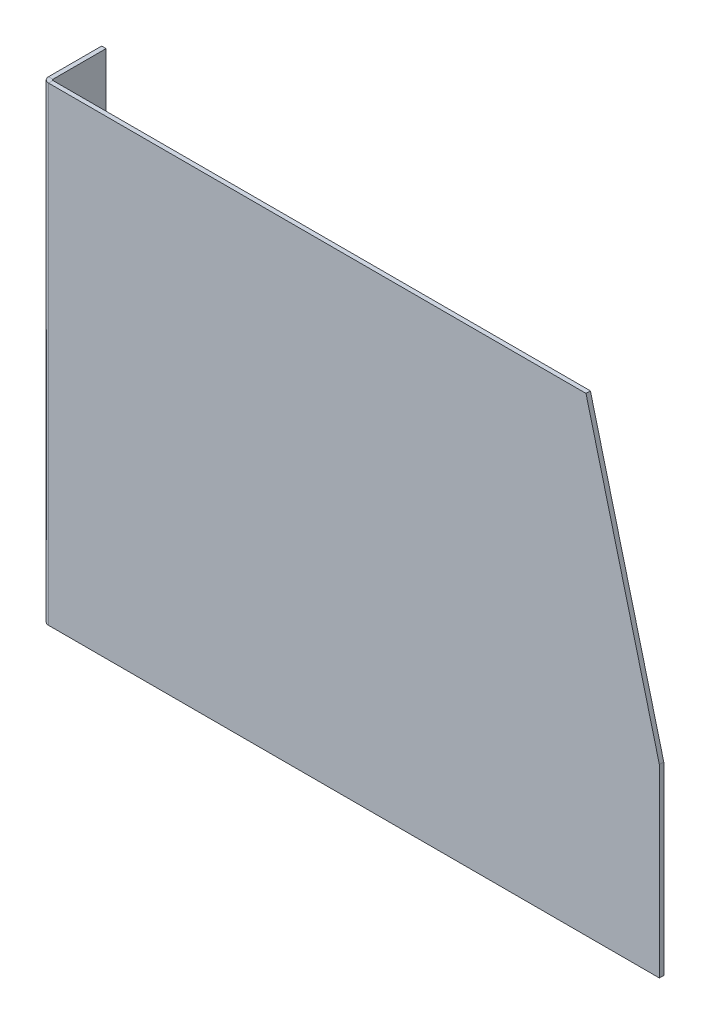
ISO-10303-21;
HEADER;
FILE_DESCRIPTION(('STEP AP214'),'2;1');
FILE_NAME('part.step','',(''),(''),'','','');
FILE_SCHEMA(('AUTOMOTIVE_DESIGN { 1 0 10303 214 1 1 1 1 }'));
ENDSEC;
DATA;
#1=APPLICATION_CONTEXT('core data for automotive mechanical design processes');
#2=APPLICATION_PROTOCOL_DEFINITION('international standard','automotive_design',2000,#1);
#3=PRODUCT_CONTEXT('',#1,'mechanical');
#4=PRODUCT('Part','Part','',(#3));
#5=PRODUCT_RELATED_PRODUCT_CATEGORY('part','',(#4));
#6=PRODUCT_DEFINITION_FORMATION('','',#4);
#7=PRODUCT_DEFINITION_CONTEXT('part definition',#1,'design');
#8=PRODUCT_DEFINITION('design','',#6,#7);
#9=PRODUCT_DEFINITION_SHAPE('','',#8);
#10=(LENGTH_UNIT() NAMED_UNIT(*) SI_UNIT(.MILLI.,.METRE.));
#11=(NAMED_UNIT(*) PLANE_ANGLE_UNIT() SI_UNIT($,.RADIAN.));
#12=(NAMED_UNIT(*) SI_UNIT($,.STERADIAN.) SOLID_ANGLE_UNIT());
#13=UNCERTAINTY_MEASURE_WITH_UNIT(LENGTH_MEASURE(1.E-05),#10,'distance_accuracy_value','');
#14=(GEOMETRIC_REPRESENTATION_CONTEXT(3) GLOBAL_UNCERTAINTY_ASSIGNED_CONTEXT((#13)) GLOBAL_UNIT_ASSIGNED_CONTEXT((#10,
#11,#12)) REPRESENTATION_CONTEXT('',''));
#15=CARTESIAN_POINT('',(0.,0.,0.));
#16=DIRECTION('',(0.,0.,1.));
#17=DIRECTION('',(1.,0.,0.));
#18=AXIS2_PLACEMENT_3D('',#15,#16,#17);
#19=CARTESIAN_POINT('',(417.,-320.,3.));
#20=DIRECTION('',(0.,1.,0.));
#21=DIRECTION('',(-1.,0.,0.));
#22=AXIS2_PLACEMENT_3D('',#19,#20,#21);
#23=PLANE('',#22);
#24=DIRECTION('',(0.,0.,1.));
#25=VECTOR('',#24,1.);
#26=CARTESIAN_POINT('',(0.736599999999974,-320.,0.));
#27=LINE('',#26,#25);
#28=CARTESIAN_POINT('',(0.736599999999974,-320.,0.));
#29=VERTEX_POINT('',#28);
#30=CARTESIAN_POINT('',(0.736599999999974,-320.,3.));
#31=VERTEX_POINT('',#30);
#32=EDGE_CURVE('E173',#29,#31,#27,.T.);
#33=ORIENTED_EDGE('',*,*,#32,.F.);
#34=DIRECTION('',(1.,0.,0.));
#35=VECTOR('',#34,1.);
#36=CARTESIAN_POINT('',(417.,-320.,0.));
#37=LINE('',#36,#35);
#38=CARTESIAN_POINT('',(417.,-320.,0.));
#39=VERTEX_POINT('',#38);
#40=EDGE_CURVE('E176',#29,#39,#37,.T.);
#41=ORIENTED_EDGE('',*,*,#40,.T.);
#42=DIRECTION('',(0.,0.,-1.));
#43=VECTOR('',#42,1.);
#44=CARTESIAN_POINT('',(417.,-320.,3.));
#45=LINE('',#44,#43);
#46=CARTESIAN_POINT('',(417.,-320.,3.));
#47=VERTEX_POINT('',#46);
#48=EDGE_CURVE('E11',#47,#39,#45,.T.);
#49=ORIENTED_EDGE('',*,*,#48,.F.);
#50=DIRECTION('',(1.,0.,0.));
#51=VECTOR('',#50,1.);
#52=CARTESIAN_POINT('',(417.,-320.,3.));
#53=LINE('',#52,#51);
#54=EDGE_CURVE('E186',#31,#47,#53,.T.);
#55=ORIENTED_EDGE('',*,*,#54,.F.);
#56=EDGE_LOOP('',(#33,#41,#49,#55));
#57=FACE_BOUND('',#56,.T.);
#58=ADVANCED_FACE('F43',(#57),#23,.F.);
#59=CARTESIAN_POINT('',(0.,0.,3.));
#60=DIRECTION('',(0.,-1.,0.));
#61=DIRECTION('',(0.,0.,-1.));
#62=AXIS2_PLACEMENT_3D('',#59,#60,#61);
#63=PLANE('',#62);
#64=DIRECTION('',(0.,0.,1.));
#65=VECTOR('',#64,1.);
#66=CARTESIAN_POINT('',(0.736599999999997,0.,0.));
#67=LINE('',#66,#65);
#68=CARTESIAN_POINT('',(0.736599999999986,0.,0.));
#69=VERTEX_POINT('',#68);
#70=CARTESIAN_POINT('',(0.73659999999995,0.,2.99999999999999));
#71=VERTEX_POINT('',#70);
#72=EDGE_CURVE('E171',#69,#71,#67,.T.);
#73=ORIENTED_EDGE('',*,*,#72,.T.);
#74=DIRECTION('',(-1.,0.,0.));
#75=VECTOR('',#74,1.);
#76=CARTESIAN_POINT('',(0.,0.,3.));
#77=LINE('',#76,#75);
#78=CARTESIAN_POINT('',(367.,0.,3.));
#79=VERTEX_POINT('',#78);
#80=EDGE_CURVE('E191',#79,#71,#77,.T.);
#81=ORIENTED_EDGE('',*,*,#80,.F.);
#82=DIRECTION('',(0.,0.,-1.));
#83=VECTOR('',#82,1.);
#84=CARTESIAN_POINT('',(367.,0.,3.));
#85=LINE('',#84,#83);
#86=CARTESIAN_POINT('',(367.,0.,0.));
#87=VERTEX_POINT('',#86);
#88=EDGE_CURVE('E193',#79,#87,#85,.T.);
#89=ORIENTED_EDGE('',*,*,#88,.T.);
#90=DIRECTION('',(-1.,0.,0.));
#91=VECTOR('',#90,1.);
#92=CARTESIAN_POINT('',(0.,0.,0.));
#93=LINE('',#92,#91);
#94=EDGE_CURVE('E184',#87,#69,#93,.T.);
#95=ORIENTED_EDGE('',*,*,#94,.T.);
#96=EDGE_LOOP('',(#73,#81,#89,#95));
#97=FACE_BOUND('',#96,.T.);
#98=ADVANCED_FACE('F205',(#97),#63,.F.);
#99=CARTESIAN_POINT('',(0.,0.,3.));
#100=DIRECTION('',(0.,0.,-1.));
#101=DIRECTION('',(-1.,0.,0.));
#102=AXIS2_PLACEMENT_3D('',#99,#100,#101);
#103=PLANE('',#102);
#104=DIRECTION('',(0.,1.,0.));
#105=VECTOR('',#104,1.);
#106=CARTESIAN_POINT('',(0.73659999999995,0.,2.99999999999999));
#107=LINE('',#106,#105);
#108=EDGE_CURVE('E122',#71,#31,#107,.F.);
#109=ORIENTED_EDGE('',*,*,#108,.T.);
#110=ORIENTED_EDGE('',*,*,#54,.T.);
#111=DIRECTION('',(0.,1.,0.));
#112=VECTOR('',#111,1.);
#113=CARTESIAN_POINT('',(417.,-194.,3.));
#114=LINE('',#113,#112);
#115=CARTESIAN_POINT('',(417.,-194.,3.));
#116=VERTEX_POINT('',#115);
#117=EDGE_CURVE('E188',#47,#116,#114,.T.);
#118=ORIENTED_EDGE('',*,*,#117,.T.);
#119=DIRECTION('',(-0.249576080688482,0.968355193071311,0.));
#120=VECTOR('',#119,1.);
#121=CARTESIAN_POINT('',(367.,0.,3.));
#122=LINE('',#121,#120);
#123=EDGE_CURVE('E65',#116,#79,#122,.T.);
#124=ORIENTED_EDGE('',*,*,#123,.T.);
#125=ORIENTED_EDGE('',*,*,#80,.T.);
#126=EDGE_LOOP('',(#109,#110,#118,#124,#125));
#127=FACE_BOUND('',#126,.T.);
#128=ADVANCED_FACE('F239',(#127),#103,.F.);
#129=CARTESIAN_POINT('',(0.,0.,0.));
#130=DIRECTION('',(0.,0.,-1.));
#131=DIRECTION('',(-1.,0.,0.));
#132=AXIS2_PLACEMENT_3D('',#129,#130,#131);
#133=PLANE('',#132);
#134=ORIENTED_EDGE('',*,*,#40,.F.);
#135=DIRECTION('',(0.,1.,0.));
#136=VECTOR('',#135,1.);
#137=CARTESIAN_POINT('',(0.736599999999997,0.,0.));
#138=LINE('',#137,#136);
#139=EDGE_CURVE('E57',#69,#29,#138,.F.);
#140=ORIENTED_EDGE('',*,*,#139,.F.);
#141=ORIENTED_EDGE('',*,*,#94,.F.);
#142=DIRECTION('',(-0.249576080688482,0.968355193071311,0.));
#143=VECTOR('',#142,1.);
#144=CARTESIAN_POINT('',(367.,0.,0.));
#145=LINE('',#144,#143);
#146=CARTESIAN_POINT('',(417.,-194.,0.));
#147=VERTEX_POINT('',#146);
#148=EDGE_CURVE('E182',#147,#87,#145,.T.);
#149=ORIENTED_EDGE('',*,*,#148,.F.);
#150=DIRECTION('',(0.,1.,0.));
#151=VECTOR('',#150,1.);
#152=CARTESIAN_POINT('',(417.,-194.,0.));
#153=LINE('',#152,#151);
#154=EDGE_CURVE('E180',#39,#147,#153,.T.);
#155=ORIENTED_EDGE('',*,*,#154,.F.);
#156=EDGE_LOOP('',(#134,#140,#141,#149,#155));
#157=FACE_BOUND('',#156,.T.);
#158=ADVANCED_FACE('F203',(#157),#133,.T.);
#159=CARTESIAN_POINT('',(417.,-194.,3.));
#160=DIRECTION('',(-1.,0.,0.));
#161=DIRECTION('',(0.,-1.,0.));
#162=AXIS2_PLACEMENT_3D('',#159,#160,#161);
#163=PLANE('',#162);
#164=ORIENTED_EDGE('',*,*,#154,.T.);
#165=DIRECTION('',(0.,0.,-1.));
#166=VECTOR('',#165,1.);
#167=CARTESIAN_POINT('',(417.,-194.,3.));
#168=LINE('',#167,#166);
#169=EDGE_CURVE('E50',#116,#147,#168,.T.);
#170=ORIENTED_EDGE('',*,*,#169,.F.);
#171=ORIENTED_EDGE('',*,*,#117,.F.);
#172=ORIENTED_EDGE('',*,*,#48,.T.);
#173=EDGE_LOOP('',(#164,#170,#171,#172));
#174=FACE_BOUND('',#173,.T.);
#175=ADVANCED_FACE('F252',(#174),#163,.F.);
#176=CARTESIAN_POINT('',(367.,0.,3.));
#177=DIRECTION('',(-0.968355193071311,-0.249576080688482,0.));
#178=DIRECTION('',(0.249576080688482,-0.968355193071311,0.));
#179=AXIS2_PLACEMENT_3D('',#176,#177,#178);
#180=PLANE('',#179);
#181=ORIENTED_EDGE('',*,*,#148,.T.);
#182=ORIENTED_EDGE('',*,*,#88,.F.);
#183=ORIENTED_EDGE('',*,*,#123,.F.);
#184=ORIENTED_EDGE('',*,*,#169,.T.);
#185=EDGE_LOOP('',(#181,#182,#183,#184));
#186=FACE_BOUND('',#185,.T.);
#187=ADVANCED_FACE('F199',(#186),#180,.F.);
#188=CARTESIAN_POINT('',(0.736599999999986,-320.,-0.7366));
#189=DIRECTION('',(0.,-1.,0.));
#190=DIRECTION('',(1.,0.,0.));
#191=AXIS2_PLACEMENT_3D('',#188,#189,#190);
#192=PLANE('',#191);
#193=DIRECTION('',(-1.,0.,0.));
#194=VECTOR('',#193,1.);
#195=CARTESIAN_POINT('',(0.,-320.,-0.736599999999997));
#196=LINE('',#195,#194);
#197=CARTESIAN_POINT('',(0.,-320.,-0.736599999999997));
#198=VERTEX_POINT('',#197);
#199=CARTESIAN_POINT('',(-3.,-320.,-0.736599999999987));
#200=VERTEX_POINT('',#199);
#201=EDGE_CURVE('E213',#198,#200,#196,.T.);
#202=ORIENTED_EDGE('',*,*,#201,.F.);
#203=CARTESIAN_POINT('',(0.736599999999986,-320.,-0.7366));
#204=DIRECTION('',(0.,1.,0.));
#205=DIRECTION('',(-1.,0.,0.));
#206=AXIS2_PLACEMENT_3D('',#203,#204,#205);
#207=CIRCLE('',#206,0.736599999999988);
#208=EDGE_CURVE('E125',#29,#198,#207,.F.);
#209=ORIENTED_EDGE('',*,*,#208,.F.);
#210=ORIENTED_EDGE('',*,*,#32,.T.);
#211=CARTESIAN_POINT('',(0.736599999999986,-320.,-0.7366));
#212=DIRECTION('',(0.,1.,0.));
#213=DIRECTION('',(-1.,0.,0.));
#214=AXIS2_PLACEMENT_3D('',#211,#212,#213);
#215=CIRCLE('',#214,3.73659999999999);
#216=EDGE_CURVE('E170',#31,#200,#215,.F.);
#217=ORIENTED_EDGE('',*,*,#216,.T.);
#218=EDGE_LOOP('',(#202,#209,#210,#217));
#219=FACE_BOUND('',#218,.T.);
#220=ADVANCED_FACE('F244',(#219),#192,.T.);
#221=CARTESIAN_POINT('',(0.736600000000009,0.,-0.7366));
#222=DIRECTION('',(0.,-1.,0.));
#223=DIRECTION('',(1.,0.,0.));
#224=AXIS2_PLACEMENT_3D('',#221,#222,#223);
#225=PLANE('',#224);
#226=CARTESIAN_POINT('',(0.736600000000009,0.,-0.7366));
#227=DIRECTION('',(0.,1.,0.));
#228=DIRECTION('',(-1.,0.,0.));
#229=AXIS2_PLACEMENT_3D('',#226,#227,#228);
#230=CIRCLE('',#229,0.736599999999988);
#231=CARTESIAN_POINT('',(0.,0.,-0.736599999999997));
#232=VERTEX_POINT('',#231);
#233=EDGE_CURVE('E132',#232,#69,#230,.T.);
#234=ORIENTED_EDGE('',*,*,#233,.F.);
#235=DIRECTION('',(-1.,0.,0.));
#236=VECTOR('',#235,1.);
#237=CARTESIAN_POINT('',(0.,0.,-0.736599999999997));
#238=LINE('',#237,#236);
#239=CARTESIAN_POINT('',(-3.,0.,-0.736599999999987));
#240=VERTEX_POINT('',#239);
#241=EDGE_CURVE('E129',#232,#240,#238,.T.);
#242=ORIENTED_EDGE('',*,*,#241,.T.);
#243=CARTESIAN_POINT('',(0.736600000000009,0.,-0.7366));
#244=DIRECTION('',(0.,1.,0.));
#245=DIRECTION('',(-1.,0.,0.));
#246=AXIS2_PLACEMENT_3D('',#243,#244,#245);
#247=CIRCLE('',#246,3.73659999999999);
#248=EDGE_CURVE('E115',#240,#71,#247,.T.);
#249=ORIENTED_EDGE('',*,*,#248,.T.);
#250=ORIENTED_EDGE('',*,*,#72,.F.);
#251=EDGE_LOOP('',(#234,#242,#249,#250));
#252=FACE_BOUND('',#251,.T.);
#253=ADVANCED_FACE('F130',(#252),#225,.F.);
#254=CARTESIAN_POINT('',(0.736600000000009,0.,-0.7366));
#255=DIRECTION('',(0.,1.,0.));
#256=DIRECTION('',(-1.,0.,0.));
#257=AXIS2_PLACEMENT_3D('',#254,#255,#256);
#258=CYLINDRICAL_SURFACE('',#257,3.73659999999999);
#259=ORIENTED_EDGE('',*,*,#108,.F.);
#260=ORIENTED_EDGE('',*,*,#248,.F.);
#261=DIRECTION('',(0.,-1.,0.));
#262=VECTOR('',#261,1.);
#263=CARTESIAN_POINT('',(-3.,0.,-0.736599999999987));
#264=LINE('',#263,#262);
#265=EDGE_CURVE('E120',#240,#200,#264,.T.);
#266=ORIENTED_EDGE('',*,*,#265,.T.);
#267=ORIENTED_EDGE('',*,*,#216,.F.);
#268=EDGE_LOOP('',(#259,#260,#266,#267));
#269=FACE_BOUND('',#268,.T.);
#270=ADVANCED_FACE('F117',(#269),#258,.T.);
#271=CARTESIAN_POINT('',(0.736600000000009,0.,-0.7366));
#272=DIRECTION('',(0.,1.,0.));
#273=DIRECTION('',(-1.,0.,0.));
#274=AXIS2_PLACEMENT_3D('',#271,#272,#273);
#275=CYLINDRICAL_SURFACE('',#274,0.736599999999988);
#276=ORIENTED_EDGE('',*,*,#139,.T.);
#277=ORIENTED_EDGE('',*,*,#208,.T.);
#278=DIRECTION('',(0.,1.,0.));
#279=VECTOR('',#278,1.);
#280=CARTESIAN_POINT('',(0.,-320.,-0.736599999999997));
#281=LINE('',#280,#279);
#282=EDGE_CURVE('E136',#198,#232,#281,.T.);
#283=ORIENTED_EDGE('',*,*,#282,.T.);
#284=ORIENTED_EDGE('',*,*,#233,.T.);
#285=EDGE_LOOP('',(#276,#277,#283,#284));
#286=FACE_BOUND('',#285,.T.);
#287=ADVANCED_FACE('F208',(#286),#275,.F.);
#288=CARTESIAN_POINT('',(-3.00000000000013,0.,-37.));
#289=DIRECTION('',(0.,-1.,0.));
#290=DIRECTION('',(0.,0.,-1.));
#291=AXIS2_PLACEMENT_3D('',#288,#289,#290);
#292=PLANE('',#291);
#293=ORIENTED_EDGE('',*,*,#241,.F.);
#294=DIRECTION('',(0.,0.,-1.));
#295=VECTOR('',#294,1.);
#296=CARTESIAN_POINT('',(-1.29184884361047E-13,0.,-37.));
#297=LINE('',#296,#295);
#298=CARTESIAN_POINT('',(-1.29184884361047E-13,0.,-37.));
#299=VERTEX_POINT('',#298);
#300=EDGE_CURVE('E145',#232,#299,#297,.T.);
#301=ORIENTED_EDGE('',*,*,#300,.T.);
#302=DIRECTION('',(1.,0.,0.));
#303=VECTOR('',#302,1.);
#304=CARTESIAN_POINT('',(-3.00000000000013,0.,-37.));
#305=LINE('',#304,#303);
#306=CARTESIAN_POINT('',(-3.00000000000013,0.,-37.));
#307=VERTEX_POINT('',#306);
#308=EDGE_CURVE('E150',#307,#299,#305,.T.);
#309=ORIENTED_EDGE('',*,*,#308,.F.);
#310=DIRECTION('',(0.,0.,-1.));
#311=VECTOR('',#310,1.);
#312=CARTESIAN_POINT('',(-3.00000000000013,0.,-37.));
#313=LINE('',#312,#311);
#314=EDGE_CURVE('E141',#240,#307,#313,.T.);
#315=ORIENTED_EDGE('',*,*,#314,.F.);
#316=EDGE_LOOP('',(#293,#301,#309,#315));
#317=FACE_BOUND('',#316,.T.);
#318=ADVANCED_FACE('F148',(#317),#292,.F.);
#319=CARTESIAN_POINT('',(-3.,-320.,0.));
#320=DIRECTION('',(0.,1.,0.));
#321=DIRECTION('',(0.,0.,1.));
#322=AXIS2_PLACEMENT_3D('',#319,#320,#321);
#323=PLANE('',#322);
#324=ORIENTED_EDGE('',*,*,#201,.T.);
#325=DIRECTION('',(0.,0.,1.));
#326=VECTOR('',#325,1.);
#327=CARTESIAN_POINT('',(-3.,-320.,0.));
#328=LINE('',#327,#326);
#329=CARTESIAN_POINT('',(-3.00000000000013,-320.,-37.));
#330=VERTEX_POINT('',#329);
#331=EDGE_CURVE('E144',#330,#200,#328,.T.);
#332=ORIENTED_EDGE('',*,*,#331,.F.);
#333=DIRECTION('',(1.,0.,0.));
#334=VECTOR('',#333,1.);
#335=CARTESIAN_POINT('',(-3.00000000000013,-320.,-37.));
#336=LINE('',#335,#334);
#337=CARTESIAN_POINT('',(-1.29184884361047E-13,-320.,-37.));
#338=VERTEX_POINT('',#337);
#339=EDGE_CURVE('E161',#330,#338,#336,.T.);
#340=ORIENTED_EDGE('',*,*,#339,.T.);
#341=DIRECTION('',(0.,0.,1.));
#342=VECTOR('',#341,1.);
#343=CARTESIAN_POINT('',(0.,-320.,0.));
#344=LINE('',#343,#342);
#345=EDGE_CURVE('E152',#338,#198,#344,.T.);
#346=ORIENTED_EDGE('',*,*,#345,.T.);
#347=EDGE_LOOP('',(#324,#332,#340,#346));
#348=FACE_BOUND('',#347,.T.);
#349=ADVANCED_FACE('F223',(#348),#323,.F.);
#350=CARTESIAN_POINT('',(-3.,0.,0.));
#351=DIRECTION('',(1.,0.,0.));
#352=DIRECTION('',(0.,0.,-1.));
#353=AXIS2_PLACEMENT_3D('',#350,#351,#352);
#354=PLANE('',#353);
#355=ORIENTED_EDGE('',*,*,#265,.F.);
#356=ORIENTED_EDGE('',*,*,#314,.T.);
#357=DIRECTION('',(0.,-1.,0.));
#358=VECTOR('',#357,1.);
#359=CARTESIAN_POINT('',(-3.00000000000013,-320.,-37.));
#360=LINE('',#359,#358);
#361=EDGE_CURVE('E151',#307,#330,#360,.T.);
#362=ORIENTED_EDGE('',*,*,#361,.T.);
#363=ORIENTED_EDGE('',*,*,#331,.T.);
#364=EDGE_LOOP('',(#355,#356,#362,#363));
#365=FACE_BOUND('',#364,.T.);
#366=ADVANCED_FACE('F140',(#365),#354,.F.);
#367=CARTESIAN_POINT('',(0.,0.,0.));
#368=DIRECTION('',(1.,0.,0.));
#369=DIRECTION('',(0.,0.,-1.));
#370=AXIS2_PLACEMENT_3D('',#367,#368,#369);
#371=PLANE('',#370);
#372=ORIENTED_EDGE('',*,*,#300,.F.);
#373=ORIENTED_EDGE('',*,*,#282,.F.);
#374=ORIENTED_EDGE('',*,*,#345,.F.);
#375=DIRECTION('',(0.,-1.,0.));
#376=VECTOR('',#375,1.);
#377=CARTESIAN_POINT('',(-1.29184884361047E-13,-320.,-37.));
#378=LINE('',#377,#376);
#379=EDGE_CURVE('E156',#299,#338,#378,.T.);
#380=ORIENTED_EDGE('',*,*,#379,.F.);
#381=EDGE_LOOP('',(#372,#373,#374,#380));
#382=FACE_BOUND('',#381,.T.);
#383=ADVANCED_FACE('F224',(#382),#371,.T.);
#384=CARTESIAN_POINT('',(-3.00000000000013,-320.,-37.));
#385=DIRECTION('',(0.,0.,1.));
#386=DIRECTION('',(1.,0.,0.));
#387=AXIS2_PLACEMENT_3D('',#384,#385,#386);
#388=PLANE('',#387);
#389=ORIENTED_EDGE('',*,*,#379,.T.);
#390=ORIENTED_EDGE('',*,*,#339,.F.);
#391=ORIENTED_EDGE('',*,*,#361,.F.);
#392=ORIENTED_EDGE('',*,*,#308,.T.);
#393=EDGE_LOOP('',(#389,#390,#391,#392));
#394=FACE_BOUND('',#393,.T.);
#395=ADVANCED_FACE('F221',(#394),#388,.F.);
#396=CLOSED_SHELL('',(#58,#98,#128,#158,#175,#187,#220,#253,#270,#287,#318,#349,#366,#383,#395));
#397=MANIFOLD_SOLID_BREP('B2',#396);
#398=ADVANCED_BREP_SHAPE_REPRESENTATION('',(#18,#397),#14);
#399=SHAPE_DEFINITION_REPRESENTATION(#9,#398);
ENDSEC;
END-ISO-10303-21;
